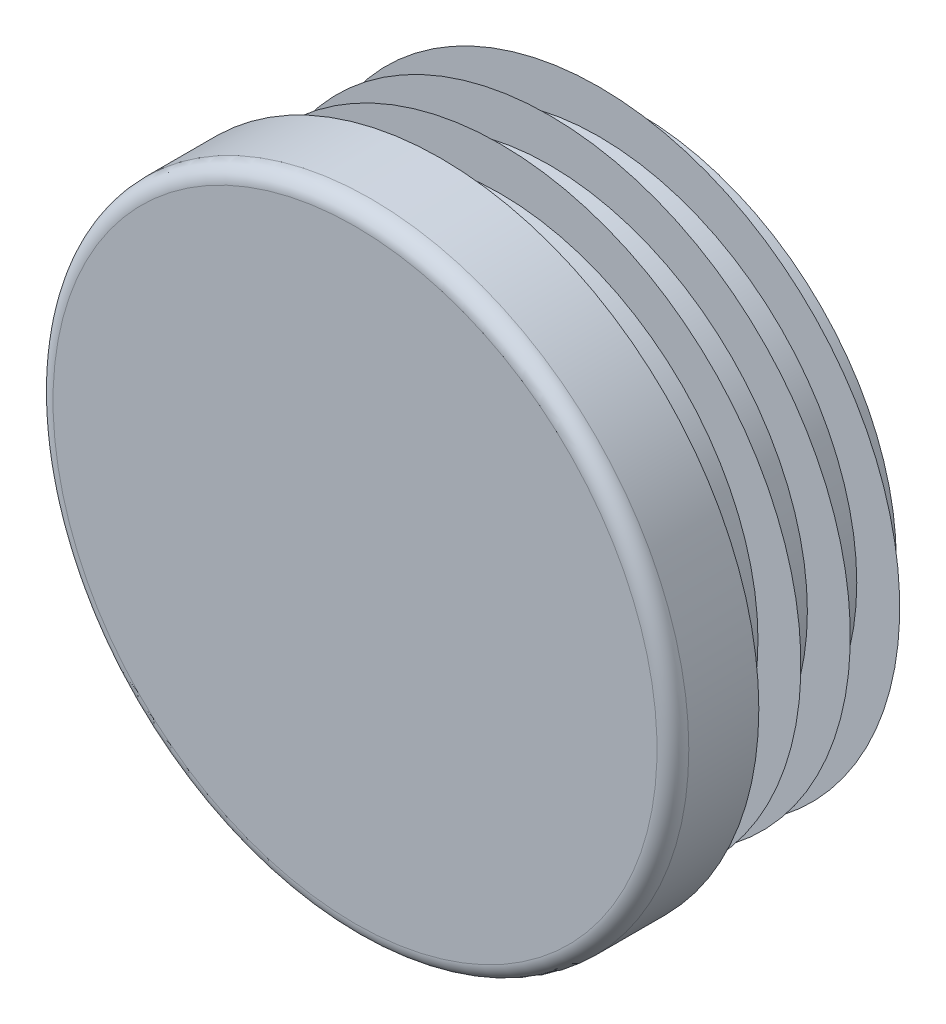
ISO-10303-21;
HEADER;
FILE_DESCRIPTION(('STEP AP214'),'2;1');
FILE_NAME('part.step','',(''),(''),'','','');
FILE_SCHEMA(('AUTOMOTIVE_DESIGN { 1 0 10303 214 1 1 1 1 }'));
ENDSEC;
DATA;
#1=APPLICATION_CONTEXT('core data for automotive mechanical design processes');
#2=APPLICATION_PROTOCOL_DEFINITION('international standard','automotive_design',2000,#1);
#3=PRODUCT_CONTEXT('',#1,'mechanical');
#4=PRODUCT('Part','Part','',(#3));
#5=PRODUCT_RELATED_PRODUCT_CATEGORY('part','',(#4));
#6=PRODUCT_DEFINITION_FORMATION('','',#4);
#7=PRODUCT_DEFINITION_CONTEXT('part definition',#1,'design');
#8=PRODUCT_DEFINITION('design','',#6,#7);
#9=PRODUCT_DEFINITION_SHAPE('','',#8);
#10=(LENGTH_UNIT() NAMED_UNIT(*) SI_UNIT(.MILLI.,.METRE.));
#11=(NAMED_UNIT(*) PLANE_ANGLE_UNIT() SI_UNIT($,.RADIAN.));
#12=(NAMED_UNIT(*) SI_UNIT($,.STERADIAN.) SOLID_ANGLE_UNIT());
#13=UNCERTAINTY_MEASURE_WITH_UNIT(LENGTH_MEASURE(1.E-05),#10,'distance_accuracy_value','');
#14=(GEOMETRIC_REPRESENTATION_CONTEXT(3) GLOBAL_UNCERTAINTY_ASSIGNED_CONTEXT((#13)) GLOBAL_UNIT_ASSIGNED_CONTEXT((#10,
#11,#12)) REPRESENTATION_CONTEXT('',''));
#15=CARTESIAN_POINT('',(0.,0.,0.));
#16=DIRECTION('',(0.,0.,1.));
#17=DIRECTION('',(1.,0.,0.));
#18=AXIS2_PLACEMENT_3D('',#15,#16,#17);
#19=CARTESIAN_POINT('',(0.,0.,5.));
#20=DIRECTION('',(0.,0.,-1.));
#21=DIRECTION('',(0.,1.,0.));
#22=AXIS2_PLACEMENT_3D('',#19,#20,#21);
#23=PLANE('',#22);
#24=CARTESIAN_POINT('',(0.,0.,5.));
#25=DIRECTION('',(0.,0.,-1.));
#26=DIRECTION('',(0.,1.,0.));
#27=AXIS2_PLACEMENT_3D('',#24,#25,#26);
#28=CIRCLE('',#27,17.575);
#29=CARTESIAN_POINT('',(0.,17.575,5.));
#30=VERTEX_POINT('',#29);
#31=EDGE_CURVE('E8',#30,#30,#28,.T.);
#32=ORIENTED_EDGE('',*,*,#31,.F.);
#33=EDGE_LOOP('',(#32));
#34=FACE_BOUND('',#33,.T.);
#35=ADVANCED_FACE('F12',(#34),#23,.F.);
#36=CARTESIAN_POINT('',(0.,0.,4.075));
#37=DIRECTION('',(0.,0.,-1.));
#38=DIRECTION('',(0.,1.,0.));
#39=AXIS2_PLACEMENT_3D('',#36,#37,#38);
#40=TOROIDAL_SURFACE('',#39,17.575,0.925);
#41=ORIENTED_EDGE('',*,*,#31,.T.);
#42=EDGE_LOOP('',(#41));
#43=FACE_BOUND('',#42,.T.);
#44=CARTESIAN_POINT('',(0.,0.,4.07500001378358));
#45=DIRECTION('',(0.,0.,-1.));
#46=DIRECTION('',(0.,1.,0.));
#47=AXIS2_PLACEMENT_3D('',#44,#45,#46);
#48=CIRCLE('',#47,18.5);
#49=CARTESIAN_POINT('',(0.,18.5,4.07500001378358));
#50=VERTEX_POINT('',#49);
#51=EDGE_CURVE('E18',#50,#50,#48,.T.);
#52=ORIENTED_EDGE('',*,*,#51,.F.);
#53=EDGE_LOOP('',(#52));
#54=FACE_BOUND('',#53,.T.);
#55=ADVANCED_FACE('F159',(#43,#54),#40,.T.);
#56=CARTESIAN_POINT('',(0.,0.,-11.5));
#57=DIRECTION('',(0.,0.,-1.));
#58=DIRECTION('',(0.,1.,0.));
#59=AXIS2_PLACEMENT_3D('',#56,#57,#58);
#60=CYLINDRICAL_SURFACE('',#59,18.5);
#61=CARTESIAN_POINT('',(0.,0.,0.));
#62=DIRECTION('',(0.,0.,-1.));
#63=DIRECTION('',(0.,1.,0.));
#64=AXIS2_PLACEMENT_3D('',#61,#62,#63);
#65=CIRCLE('',#64,18.5);
#66=CARTESIAN_POINT('',(0.,18.5,0.));
#67=VERTEX_POINT('',#66);
#68=EDGE_CURVE('E22',#67,#67,#65,.T.);
#69=ORIENTED_EDGE('',*,*,#68,.F.);
#70=EDGE_LOOP('',(#69));
#71=FACE_BOUND('',#70,.T.);
#72=ORIENTED_EDGE('',*,*,#51,.T.);
#73=EDGE_LOOP('',(#72));
#74=FACE_BOUND('',#73,.T.);
#75=ADVANCED_FACE('F154',(#71,#74),#60,.T.);
#76=CARTESIAN_POINT('',(18.5,0.,0.));
#77=DIRECTION('',(0.,0.,1.));
#78=DIRECTION('',(0.,-1.,0.));
#79=AXIS2_PLACEMENT_3D('',#76,#77,#78);
#80=PLANE('',#79);
#81=CARTESIAN_POINT('',(0.,0.,0.));
#82=DIRECTION('',(0.,0.,-1.));
#83=DIRECTION('',(0.,1.,0.));
#84=AXIS2_PLACEMENT_3D('',#81,#82,#83);
#85=CIRCLE('',#84,15.);
#86=CARTESIAN_POINT('',(0.,15.,0.));
#87=VERTEX_POINT('',#86);
#88=EDGE_CURVE('E26',#87,#87,#85,.T.);
#89=ORIENTED_EDGE('',*,*,#88,.F.);
#90=EDGE_LOOP('',(#89));
#91=FACE_BOUND('',#90,.T.);
#92=ORIENTED_EDGE('',*,*,#68,.T.);
#93=EDGE_LOOP('',(#92));
#94=FACE_BOUND('',#93,.T.);
#95=ADVANCED_FACE('F148',(#91,#94),#80,.F.);
#96=CARTESIAN_POINT('',(0.,0.,-11.5));
#97=DIRECTION('',(0.,0.,-1.));
#98=DIRECTION('',(0.,1.,0.));
#99=AXIS2_PLACEMENT_3D('',#96,#97,#98);
#100=CYLINDRICAL_SURFACE('',#99,15.);
#101=CARTESIAN_POINT('',(0.,0.,-0.575));
#102=DIRECTION('',(0.,0.,-1.));
#103=DIRECTION('',(0.,1.,0.));
#104=AXIS2_PLACEMENT_3D('',#101,#102,#103);
#105=CIRCLE('',#104,15.);
#106=CARTESIAN_POINT('',(0.,15.,-0.575));
#107=VERTEX_POINT('',#106);
#108=EDGE_CURVE('E31',#107,#107,#105,.T.);
#109=ORIENTED_EDGE('',*,*,#108,.F.);
#110=EDGE_LOOP('',(#109));
#111=FACE_BOUND('',#110,.T.);
#112=ORIENTED_EDGE('',*,*,#88,.T.);
#113=EDGE_LOOP('',(#112));
#114=FACE_BOUND('',#113,.T.);
#115=ADVANCED_FACE('F142',(#111,#114),#100,.T.);
#116=CARTESIAN_POINT('',(15.,0.,-0.575));
#117=DIRECTION('',(0.,0.,-1.));
#118=DIRECTION('',(0.,1.,0.));
#119=AXIS2_PLACEMENT_3D('',#116,#117,#118);
#120=PLANE('',#119);
#121=CARTESIAN_POINT('',(0.,0.,-0.575));
#122=DIRECTION('',(0.,0.,-1.));
#123=DIRECTION('',(0.,1.,0.));
#124=AXIS2_PLACEMENT_3D('',#121,#122,#123);
#125=CIRCLE('',#124,17.5);
#126=CARTESIAN_POINT('',(0.,17.5,-0.575));
#127=VERTEX_POINT('',#126);
#128=EDGE_CURVE('E34',#127,#127,#125,.T.);
#129=ORIENTED_EDGE('',*,*,#128,.F.);
#130=EDGE_LOOP('',(#129));
#131=FACE_BOUND('',#130,.T.);
#132=ORIENTED_EDGE('',*,*,#108,.T.);
#133=EDGE_LOOP('',(#132));
#134=FACE_BOUND('',#133,.T.);
#135=ADVANCED_FACE('F136',(#131,#134),#120,.F.);
#136=CARTESIAN_POINT('',(0.,0.,-0.575));
#137=DIRECTION('',(0.,0.,1.));
#138=DIRECTION('',(0.,-1.,0.));
#139=AXIS2_PLACEMENT_3D('',#136,#137,#138);
#140=CONICAL_SURFACE('',#139,17.5,0.959931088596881);
#141=CARTESIAN_POINT('',(0.,0.,-2.32551884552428));
#142=DIRECTION('',(0.,0.,-1.));
#143=DIRECTION('',(0.,1.,0.));
#144=AXIS2_PLACEMENT_3D('',#141,#142,#143);
#145=CIRCLE('',#144,15.);
#146=CARTESIAN_POINT('',(0.,15.,-2.32551884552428));
#147=VERTEX_POINT('',#146);
#148=EDGE_CURVE('E37',#147,#147,#145,.T.);
#149=ORIENTED_EDGE('',*,*,#148,.F.);
#150=EDGE_LOOP('',(#149));
#151=FACE_BOUND('',#150,.T.);
#152=ORIENTED_EDGE('',*,*,#128,.T.);
#153=EDGE_LOOP('',(#152));
#154=FACE_BOUND('',#153,.T.);
#155=ADVANCED_FACE('F130',(#151,#154),#140,.T.);
#156=CARTESIAN_POINT('',(0.,0.,-11.5));
#157=DIRECTION('',(0.,0.,-1.));
#158=DIRECTION('',(0.,1.,0.));
#159=AXIS2_PLACEMENT_3D('',#156,#157,#158);
#160=CYLINDRICAL_SURFACE('',#159,15.);
#161=CARTESIAN_POINT('',(0.,0.,-3.45));
#162=DIRECTION('',(0.,0.,-1.));
#163=DIRECTION('',(0.,1.,0.));
#164=AXIS2_PLACEMENT_3D('',#161,#162,#163);
#165=CIRCLE('',#164,15.);
#166=CARTESIAN_POINT('',(0.,15.,-3.45));
#167=VERTEX_POINT('',#166);
#168=EDGE_CURVE('E40',#167,#167,#165,.T.);
#169=ORIENTED_EDGE('',*,*,#168,.F.);
#170=EDGE_LOOP('',(#169));
#171=FACE_BOUND('',#170,.T.);
#172=ORIENTED_EDGE('',*,*,#148,.T.);
#173=EDGE_LOOP('',(#172));
#174=FACE_BOUND('',#173,.T.);
#175=ADVANCED_FACE('F124',(#171,#174),#160,.T.);
#176=CARTESIAN_POINT('',(15.,0.,-3.45));
#177=DIRECTION('',(0.,0.,-1.));
#178=DIRECTION('',(0.,1.,0.));
#179=AXIS2_PLACEMENT_3D('',#176,#177,#178);
#180=PLANE('',#179);
#181=CARTESIAN_POINT('',(0.,0.,-3.45));
#182=DIRECTION('',(0.,0.,-1.));
#183=DIRECTION('',(0.,1.,0.));
#184=AXIS2_PLACEMENT_3D('',#181,#182,#183);
#185=CIRCLE('',#184,17.5);
#186=CARTESIAN_POINT('',(0.,17.5,-3.45));
#187=VERTEX_POINT('',#186);
#188=EDGE_CURVE('E43',#187,#187,#185,.T.);
#189=ORIENTED_EDGE('',*,*,#188,.F.);
#190=EDGE_LOOP('',(#189));
#191=FACE_BOUND('',#190,.T.);
#192=ORIENTED_EDGE('',*,*,#168,.T.);
#193=EDGE_LOOP('',(#192));
#194=FACE_BOUND('',#193,.T.);
#195=ADVANCED_FACE('F118',(#191,#194),#180,.F.);
#196=CARTESIAN_POINT('',(0.,0.,-3.45));
#197=DIRECTION('',(0.,0.,1.));
#198=DIRECTION('',(0.,-1.,0.));
#199=AXIS2_PLACEMENT_3D('',#196,#197,#198);
#200=CONICAL_SURFACE('',#199,17.5,0.959931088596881);
#201=CARTESIAN_POINT('',(0.,0.,-5.20051884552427));
#202=DIRECTION('',(0.,0.,-1.));
#203=DIRECTION('',(0.,1.,0.));
#204=AXIS2_PLACEMENT_3D('',#201,#202,#203);
#205=CIRCLE('',#204,15.);
#206=CARTESIAN_POINT('',(0.,15.,-5.20051884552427));
#207=VERTEX_POINT('',#206);
#208=EDGE_CURVE('E46',#207,#207,#205,.T.);
#209=ORIENTED_EDGE('',*,*,#208,.F.);
#210=EDGE_LOOP('',(#209));
#211=FACE_BOUND('',#210,.T.);
#212=ORIENTED_EDGE('',*,*,#188,.T.);
#213=EDGE_LOOP('',(#212));
#214=FACE_BOUND('',#213,.T.);
#215=ADVANCED_FACE('F112',(#211,#214),#200,.T.);
#216=CARTESIAN_POINT('',(0.,0.,-11.5));
#217=DIRECTION('',(0.,0.,-1.));
#218=DIRECTION('',(0.,1.,0.));
#219=AXIS2_PLACEMENT_3D('',#216,#217,#218);
#220=CYLINDRICAL_SURFACE('',#219,15.);
#221=CARTESIAN_POINT('',(0.,0.,-6.325));
#222=DIRECTION('',(0.,0.,-1.));
#223=DIRECTION('',(0.,1.,0.));
#224=AXIS2_PLACEMENT_3D('',#221,#222,#223);
#225=CIRCLE('',#224,15.);
#226=CARTESIAN_POINT('',(0.,15.,-6.325));
#227=VERTEX_POINT('',#226);
#228=EDGE_CURVE('E49',#227,#227,#225,.T.);
#229=ORIENTED_EDGE('',*,*,#228,.F.);
#230=EDGE_LOOP('',(#229));
#231=FACE_BOUND('',#230,.T.);
#232=ORIENTED_EDGE('',*,*,#208,.T.);
#233=EDGE_LOOP('',(#232));
#234=FACE_BOUND('',#233,.T.);
#235=ADVANCED_FACE('F106',(#231,#234),#220,.T.);
#236=CARTESIAN_POINT('',(15.,0.,-6.325));
#237=DIRECTION('',(0.,0.,-1.));
#238=DIRECTION('',(0.,1.,0.));
#239=AXIS2_PLACEMENT_3D('',#236,#237,#238);
#240=PLANE('',#239);
#241=CARTESIAN_POINT('',(0.,0.,-6.325));
#242=DIRECTION('',(0.,0.,-1.));
#243=DIRECTION('',(0.,1.,0.));
#244=AXIS2_PLACEMENT_3D('',#241,#242,#243);
#245=CIRCLE('',#244,17.5);
#246=CARTESIAN_POINT('',(0.,17.5,-6.325));
#247=VERTEX_POINT('',#246);
#248=EDGE_CURVE('E52',#247,#247,#245,.T.);
#249=ORIENTED_EDGE('',*,*,#248,.F.);
#250=EDGE_LOOP('',(#249));
#251=FACE_BOUND('',#250,.T.);
#252=ORIENTED_EDGE('',*,*,#228,.T.);
#253=EDGE_LOOP('',(#252));
#254=FACE_BOUND('',#253,.T.);
#255=ADVANCED_FACE('F100',(#251,#254),#240,.F.);
#256=CARTESIAN_POINT('',(0.,0.,-6.325));
#257=DIRECTION('',(0.,0.,1.));
#258=DIRECTION('',(0.,-1.,0.));
#259=AXIS2_PLACEMENT_3D('',#256,#257,#258);
#260=CONICAL_SURFACE('',#259,17.5,0.959931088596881);
#261=CARTESIAN_POINT('',(0.,0.,-8.07551884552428));
#262=DIRECTION('',(0.,0.,-1.));
#263=DIRECTION('',(0.,1.,0.));
#264=AXIS2_PLACEMENT_3D('',#261,#262,#263);
#265=CIRCLE('',#264,15.);
#266=CARTESIAN_POINT('',(0.,15.,-8.07551884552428));
#267=VERTEX_POINT('',#266);
#268=EDGE_CURVE('E55',#267,#267,#265,.T.);
#269=ORIENTED_EDGE('',*,*,#268,.F.);
#270=EDGE_LOOP('',(#269));
#271=FACE_BOUND('',#270,.T.);
#272=ORIENTED_EDGE('',*,*,#248,.T.);
#273=EDGE_LOOP('',(#272));
#274=FACE_BOUND('',#273,.T.);
#275=ADVANCED_FACE('F94',(#271,#274),#260,.T.);
#276=CARTESIAN_POINT('',(0.,0.,-11.5));
#277=DIRECTION('',(0.,0.,-1.));
#278=DIRECTION('',(0.,1.,0.));
#279=AXIS2_PLACEMENT_3D('',#276,#277,#278);
#280=CYLINDRICAL_SURFACE('',#279,15.);
#281=CARTESIAN_POINT('',(0.,0.,-9.2));
#282=DIRECTION('',(0.,0.,-1.));
#283=DIRECTION('',(0.,1.,0.));
#284=AXIS2_PLACEMENT_3D('',#281,#282,#283);
#285=CIRCLE('',#284,15.);
#286=CARTESIAN_POINT('',(0.,15.,-9.2));
#287=VERTEX_POINT('',#286);
#288=EDGE_CURVE('E58',#287,#287,#285,.T.);
#289=ORIENTED_EDGE('',*,*,#288,.F.);
#290=EDGE_LOOP('',(#289));
#291=FACE_BOUND('',#290,.T.);
#292=ORIENTED_EDGE('',*,*,#268,.T.);
#293=EDGE_LOOP('',(#292));
#294=FACE_BOUND('',#293,.T.);
#295=ADVANCED_FACE('F88',(#291,#294),#280,.T.);
#296=CARTESIAN_POINT('',(15.,0.,-9.2));
#297=DIRECTION('',(0.,0.,-1.));
#298=DIRECTION('',(0.,1.,0.));
#299=AXIS2_PLACEMENT_3D('',#296,#297,#298);
#300=PLANE('',#299);
#301=CARTESIAN_POINT('',(0.,0.,-9.2));
#302=DIRECTION('',(0.,0.,-1.));
#303=DIRECTION('',(0.,1.,0.));
#304=AXIS2_PLACEMENT_3D('',#301,#302,#303);
#305=CIRCLE('',#304,17.5);
#306=CARTESIAN_POINT('',(0.,17.5,-9.2));
#307=VERTEX_POINT('',#306);
#308=EDGE_CURVE('E61',#307,#307,#305,.T.);
#309=ORIENTED_EDGE('',*,*,#308,.F.);
#310=EDGE_LOOP('',(#309));
#311=FACE_BOUND('',#310,.T.);
#312=ORIENTED_EDGE('',*,*,#288,.T.);
#313=EDGE_LOOP('',(#312));
#314=FACE_BOUND('',#313,.T.);
#315=ADVANCED_FACE('F82',(#311,#314),#300,.F.);
#316=CARTESIAN_POINT('',(0.,0.,-9.2));
#317=DIRECTION('',(0.,0.,1.));
#318=DIRECTION('',(0.,-1.,0.));
#319=AXIS2_PLACEMENT_3D('',#316,#317,#318);
#320=CONICAL_SURFACE('',#319,17.5,0.959931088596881);
#321=CARTESIAN_POINT('',(0.,0.,-10.9505188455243));
#322=DIRECTION('',(0.,0.,-1.));
#323=DIRECTION('',(0.,1.,0.));
#324=AXIS2_PLACEMENT_3D('',#321,#322,#323);
#325=CIRCLE('',#324,15.);
#326=CARTESIAN_POINT('',(0.,15.,-10.9505188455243));
#327=VERTEX_POINT('',#326);
#328=EDGE_CURVE('E64',#327,#327,#325,.T.);
#329=ORIENTED_EDGE('',*,*,#328,.F.);
#330=EDGE_LOOP('',(#329));
#331=FACE_BOUND('',#330,.T.);
#332=ORIENTED_EDGE('',*,*,#308,.T.);
#333=EDGE_LOOP('',(#332));
#334=FACE_BOUND('',#333,.T.);
#335=ADVANCED_FACE('F76',(#331,#334),#320,.T.);
#336=CARTESIAN_POINT('',(0.,0.,-11.5));
#337=DIRECTION('',(0.,0.,-1.));
#338=DIRECTION('',(0.,1.,0.));
#339=AXIS2_PLACEMENT_3D('',#336,#337,#338);
#340=CYLINDRICAL_SURFACE('',#339,15.);
#341=CARTESIAN_POINT('',(0.,0.,-11.5));
#342=DIRECTION('',(0.,0.,-1.));
#343=DIRECTION('',(0.,1.,0.));
#344=AXIS2_PLACEMENT_3D('',#341,#342,#343);
#345=CIRCLE('',#344,15.);
#346=CARTESIAN_POINT('',(0.,15.,-11.5));
#347=VERTEX_POINT('',#346);
#348=EDGE_CURVE('E67',#347,#347,#345,.T.);
#349=ORIENTED_EDGE('',*,*,#348,.F.);
#350=EDGE_LOOP('',(#349));
#351=FACE_BOUND('',#350,.T.);
#352=ORIENTED_EDGE('',*,*,#328,.T.);
#353=EDGE_LOOP('',(#352));
#354=FACE_BOUND('',#353,.T.);
#355=ADVANCED_FACE('F73',(#351,#354),#340,.T.);
#356=CARTESIAN_POINT('',(15.,0.,-11.5));
#357=DIRECTION('',(0.,0.,1.));
#358=DIRECTION('',(0.,-1.,0.));
#359=AXIS2_PLACEMENT_3D('',#356,#357,#358);
#360=PLANE('',#359);
#361=ORIENTED_EDGE('',*,*,#348,.T.);
#362=EDGE_LOOP('',(#361));
#363=FACE_BOUND('',#362,.T.);
#364=ADVANCED_FACE('F71',(#363),#360,.F.);
#365=CLOSED_SHELL('',(#35,#55,#75,#95,#115,#135,#155,#175,#195,#215,#235,#255,#275,#295,#315,
#335,#355,#364));
#366=MANIFOLD_SOLID_BREP('B1',#365);
#367=ADVANCED_BREP_SHAPE_REPRESENTATION('',(#18,#366),#14);
#368=SHAPE_DEFINITION_REPRESENTATION(#9,#367);
ENDSEC;
END-ISO-10303-21;
